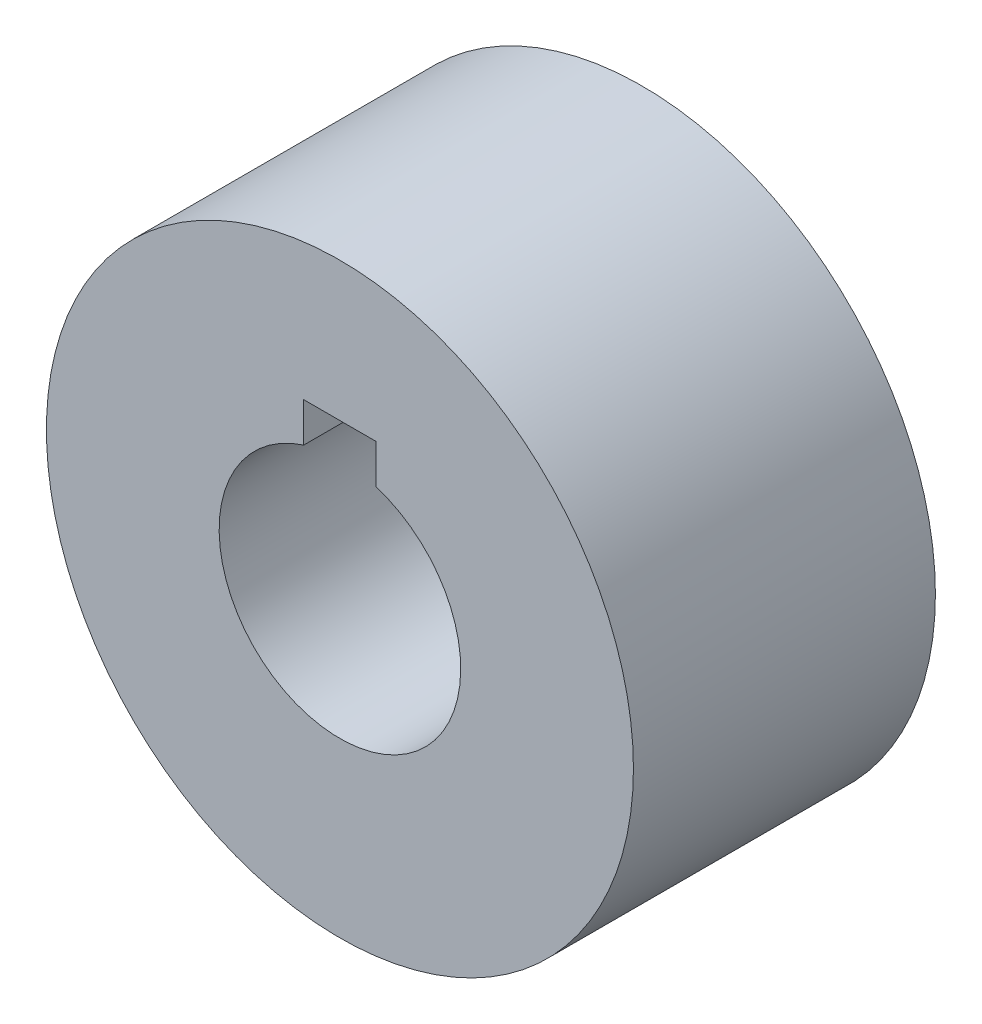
ISO-10303-21;
HEADER;
FILE_DESCRIPTION(('STEP AP214'),'2;1');
FILE_NAME('part.step','',(''),(''),'','','');
FILE_SCHEMA(('AUTOMOTIVE_DESIGN { 1 0 10303 214 1 1 1 1 }'));
ENDSEC;
DATA;
#1=APPLICATION_CONTEXT('core data for automotive mechanical design processes');
#2=APPLICATION_PROTOCOL_DEFINITION('international standard','automotive_design',2000,#1);
#3=PRODUCT_CONTEXT('',#1,'mechanical');
#4=PRODUCT('Part','Part','',(#3));
#5=PRODUCT_RELATED_PRODUCT_CATEGORY('part','',(#4));
#6=PRODUCT_DEFINITION_FORMATION('','',#4);
#7=PRODUCT_DEFINITION_CONTEXT('part definition',#1,'design');
#8=PRODUCT_DEFINITION('design','',#6,#7);
#9=PRODUCT_DEFINITION_SHAPE('','',#8);
#10=(LENGTH_UNIT() NAMED_UNIT(*) SI_UNIT(.MILLI.,.METRE.));
#11=(NAMED_UNIT(*) PLANE_ANGLE_UNIT() SI_UNIT($,.RADIAN.));
#12=(NAMED_UNIT(*) SI_UNIT($,.STERADIAN.) SOLID_ANGLE_UNIT());
#13=UNCERTAINTY_MEASURE_WITH_UNIT(LENGTH_MEASURE(1.E-05),#10,'distance_accuracy_value','');
#14=(GEOMETRIC_REPRESENTATION_CONTEXT(3) GLOBAL_UNCERTAINTY_ASSIGNED_CONTEXT((#13)) GLOBAL_UNIT_ASSIGNED_CONTEXT((#10,
#11,#12)) REPRESENTATION_CONTEXT('',''));
#15=CARTESIAN_POINT('',(0.,0.,0.));
#16=DIRECTION('',(0.,0.,1.));
#17=DIRECTION('',(1.,0.,0.));
#18=AXIS2_PLACEMENT_3D('',#15,#16,#17);
#19=CARTESIAN_POINT('',(0.,0.,12.5));
#20=DIRECTION('',(0.,0.,-1.));
#21=DIRECTION('',(-1.,0.,0.));
#22=AXIS2_PLACEMENT_3D('',#19,#20,#21);
#23=CYLINDRICAL_SURFACE('',#22,24.3);
#24=CARTESIAN_POINT('',(0.,0.,12.5));
#25=DIRECTION('',(0.,0.,1.));
#26=DIRECTION('',(1.,0.,0.));
#27=AXIS2_PLACEMENT_3D('',#24,#25,#26);
#28=CIRCLE('',#27,24.3);
#29=CARTESIAN_POINT('',(24.3,0.,12.5));
#30=VERTEX_POINT('',#29);
#31=EDGE_CURVE('E11',#30,#30,#28,.T.);
#32=ORIENTED_EDGE('',*,*,#31,.F.);
#33=EDGE_LOOP('',(#32));
#34=FACE_BOUND('',#33,.T.);
#35=CARTESIAN_POINT('',(0.,0.,-12.5));
#36=DIRECTION('',(0.,0.,1.));
#37=DIRECTION('',(1.,0.,0.));
#38=AXIS2_PLACEMENT_3D('',#35,#36,#37);
#39=CIRCLE('',#38,24.3);
#40=CARTESIAN_POINT('',(24.3,0.,-12.5));
#41=VERTEX_POINT('',#40);
#42=EDGE_CURVE('E33',#41,#41,#39,.T.);
#43=ORIENTED_EDGE('',*,*,#42,.T.);
#44=EDGE_LOOP('',(#43));
#45=FACE_BOUND('',#44,.T.);
#46=ADVANCED_FACE('F30',(#34,#45),#23,.T.);
#47=CARTESIAN_POINT('',(0.,0.,12.5));
#48=DIRECTION('',(0.,0.,1.));
#49=DIRECTION('',(1.,0.,0.));
#50=AXIS2_PLACEMENT_3D('',#47,#48,#49);
#51=PLANE('',#50);
#52=DIRECTION('',(0.,1.,0.));
#53=VECTOR('',#52,1.);
#54=CARTESIAN_POINT('',(2.99999999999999,9.53939201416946,12.5));
#55=LINE('',#54,#53);
#56=CARTESIAN_POINT('',(2.99999999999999,9.53939201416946,12.5));
#57=VERTEX_POINT('',#56);
#58=CARTESIAN_POINT('',(2.99999999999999,12.8,12.5));
#59=VERTEX_POINT('',#58);
#60=EDGE_CURVE('E44',#57,#59,#55,.T.);
#61=ORIENTED_EDGE('',*,*,#60,.F.);
#62=CARTESIAN_POINT('',(0.,0.,12.5));
#63=DIRECTION('',(0.,0.,1.));
#64=DIRECTION('',(1.,0.,0.));
#65=AXIS2_PLACEMENT_3D('',#62,#63,#64);
#66=CIRCLE('',#65,10.);
#67=CARTESIAN_POINT('',(-3.00000000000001,9.53939201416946,12.5));
#68=VERTEX_POINT('',#67);
#69=EDGE_CURVE('E88',#68,#57,#66,.T.);
#70=ORIENTED_EDGE('',*,*,#69,.F.);
#71=DIRECTION('',(0.,-1.,0.));
#72=VECTOR('',#71,1.);
#73=CARTESIAN_POINT('',(-3.00000000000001,9.53939201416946,12.5));
#74=LINE('',#73,#72);
#75=CARTESIAN_POINT('',(-3.00000000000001,12.8,12.5));
#76=VERTEX_POINT('',#75);
#77=EDGE_CURVE('E91',#76,#68,#74,.T.);
#78=ORIENTED_EDGE('',*,*,#77,.F.);
#79=DIRECTION('',(-1.,0.,0.));
#80=VECTOR('',#79,1.);
#81=CARTESIAN_POINT('',(-3.00000000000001,12.8,12.5));
#82=LINE('',#81,#80);
#83=EDGE_CURVE('E97',#59,#76,#82,.T.);
#84=ORIENTED_EDGE('',*,*,#83,.F.);
#85=EDGE_LOOP('',(#61,#70,#78,#84));
#86=FACE_BOUND('',#85,.T.);
#87=ORIENTED_EDGE('',*,*,#31,.T.);
#88=EDGE_LOOP('',(#87));
#89=FACE_BOUND('',#88,.T.);
#90=ADVANCED_FACE('F109',(#86,#89),#51,.T.);
#91=CARTESIAN_POINT('',(0.,0.,-12.5));
#92=DIRECTION('',(0.,0.,1.));
#93=DIRECTION('',(1.,0.,0.));
#94=AXIS2_PLACEMENT_3D('',#91,#92,#93);
#95=PLANE('',#94);
#96=CARTESIAN_POINT('',(0.,0.,-12.5));
#97=DIRECTION('',(0.,0.,1.));
#98=DIRECTION('',(1.,0.,0.));
#99=AXIS2_PLACEMENT_3D('',#96,#97,#98);
#100=CIRCLE('',#99,10.);
#101=CARTESIAN_POINT('',(-3.00000000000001,9.53939201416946,-12.5));
#102=VERTEX_POINT('',#101);
#103=CARTESIAN_POINT('',(2.99999999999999,9.53939201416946,-12.5));
#104=VERTEX_POINT('',#103);
#105=EDGE_CURVE('E78',#102,#104,#100,.T.);
#106=ORIENTED_EDGE('',*,*,#105,.T.);
#107=DIRECTION('',(0.,1.,0.));
#108=VECTOR('',#107,1.);
#109=CARTESIAN_POINT('',(2.99999999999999,9.53939201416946,-12.5));
#110=LINE('',#109,#108);
#111=CARTESIAN_POINT('',(2.99999999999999,12.8,-12.5));
#112=VERTEX_POINT('',#111);
#113=EDGE_CURVE('E72',#104,#112,#110,.T.);
#114=ORIENTED_EDGE('',*,*,#113,.T.);
#115=DIRECTION('',(-1.,0.,0.));
#116=VECTOR('',#115,1.);
#117=CARTESIAN_POINT('',(-3.00000000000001,12.8,-12.5));
#118=LINE('',#117,#116);
#119=CARTESIAN_POINT('',(-3.00000000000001,12.8,-12.5));
#120=VERTEX_POINT('',#119);
#121=EDGE_CURVE('E81',#112,#120,#118,.T.);
#122=ORIENTED_EDGE('',*,*,#121,.T.);
#123=DIRECTION('',(0.,-1.,0.));
#124=VECTOR('',#123,1.);
#125=CARTESIAN_POINT('',(-3.00000000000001,9.53939201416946,-12.5));
#126=LINE('',#125,#124);
#127=EDGE_CURVE('E52',#120,#102,#126,.T.);
#128=ORIENTED_EDGE('',*,*,#127,.T.);
#129=EDGE_LOOP('',(#106,#114,#122,#128));
#130=FACE_BOUND('',#129,.T.);
#131=ORIENTED_EDGE('',*,*,#42,.F.);
#132=EDGE_LOOP('',(#131));
#133=FACE_BOUND('',#132,.T.);
#134=ADVANCED_FACE('F85',(#130,#133),#95,.F.);
#135=CARTESIAN_POINT('',(2.99999999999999,9.53939201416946,-12.5));
#136=DIRECTION('',(1.,0.,0.));
#137=DIRECTION('',(0.,0.,-1.));
#138=AXIS2_PLACEMENT_3D('',#135,#136,#137);
#139=PLANE('',#138);
#140=ORIENTED_EDGE('',*,*,#60,.T.);
#141=DIRECTION('',(0.,0.,1.));
#142=VECTOR('',#141,1.);
#143=CARTESIAN_POINT('',(2.99999999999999,12.8,-12.5));
#144=LINE('',#143,#142);
#145=EDGE_CURVE('E68',#112,#59,#144,.T.);
#146=ORIENTED_EDGE('',*,*,#145,.F.);
#147=ORIENTED_EDGE('',*,*,#113,.F.);
#148=DIRECTION('',(0.,0.,1.));
#149=VECTOR('',#148,1.);
#150=CARTESIAN_POINT('',(2.99999999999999,9.53939201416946,-12.5));
#151=LINE('',#150,#149);
#152=EDGE_CURVE('E101',#104,#57,#151,.T.);
#153=ORIENTED_EDGE('',*,*,#152,.T.);
#154=EDGE_LOOP('',(#140,#146,#147,#153));
#155=FACE_BOUND('',#154,.T.);
#156=ADVANCED_FACE('F70',(#155),#139,.F.);
#157=CARTESIAN_POINT('',(0.,0.,-12.5));
#158=DIRECTION('',(0.,0.,1.));
#159=DIRECTION('',(1.,0.,0.));
#160=AXIS2_PLACEMENT_3D('',#157,#158,#159);
#161=CYLINDRICAL_SURFACE('',#160,10.);
#162=ORIENTED_EDGE('',*,*,#69,.T.);
#163=ORIENTED_EDGE('',*,*,#152,.F.);
#164=ORIENTED_EDGE('',*,*,#105,.F.);
#165=DIRECTION('',(0.,0.,1.));
#166=VECTOR('',#165,1.);
#167=CARTESIAN_POINT('',(-3.00000000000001,9.53939201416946,-12.5));
#168=LINE('',#167,#166);
#169=EDGE_CURVE('E103',#102,#68,#168,.T.);
#170=ORIENTED_EDGE('',*,*,#169,.T.);
#171=EDGE_LOOP('',(#162,#163,#164,#170));
#172=FACE_BOUND('',#171,.T.);
#173=ADVANCED_FACE('F112',(#172),#161,.F.);
#174=CARTESIAN_POINT('',(-3.00000000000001,9.53939201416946,-12.5));
#175=DIRECTION('',(-1.,0.,0.));
#176=DIRECTION('',(0.,0.,1.));
#177=AXIS2_PLACEMENT_3D('',#174,#175,#176);
#178=PLANE('',#177);
#179=ORIENTED_EDGE('',*,*,#77,.T.);
#180=ORIENTED_EDGE('',*,*,#169,.F.);
#181=ORIENTED_EDGE('',*,*,#127,.F.);
#182=DIRECTION('',(0.,0.,1.));
#183=VECTOR('',#182,1.);
#184=CARTESIAN_POINT('',(-3.00000000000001,12.8,-12.5));
#185=LINE('',#184,#183);
#186=EDGE_CURVE('E77',#120,#76,#185,.T.);
#187=ORIENTED_EDGE('',*,*,#186,.T.);
#188=EDGE_LOOP('',(#179,#180,#181,#187));
#189=FACE_BOUND('',#188,.T.);
#190=ADVANCED_FACE('F105',(#189),#178,.F.);
#191=CARTESIAN_POINT('',(-3.00000000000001,12.8,-12.5));
#192=DIRECTION('',(0.,1.,0.));
#193=DIRECTION('',(0.,0.,1.));
#194=AXIS2_PLACEMENT_3D('',#191,#192,#193);
#195=PLANE('',#194);
#196=ORIENTED_EDGE('',*,*,#83,.T.);
#197=ORIENTED_EDGE('',*,*,#186,.F.);
#198=ORIENTED_EDGE('',*,*,#121,.F.);
#199=ORIENTED_EDGE('',*,*,#145,.T.);
#200=EDGE_LOOP('',(#196,#197,#198,#199));
#201=FACE_BOUND('',#200,.T.);
#202=ADVANCED_FACE('F82',(#201),#195,.F.);
#203=CLOSED_SHELL('',(#46,#90,#134,#156,#173,#190,#202));
#204=MANIFOLD_SOLID_BREP('B2',#203);
#205=ADVANCED_BREP_SHAPE_REPRESENTATION('',(#18,#204),#14);
#206=SHAPE_DEFINITION_REPRESENTATION(#9,#205);
ENDSEC;
END-ISO-10303-21;
